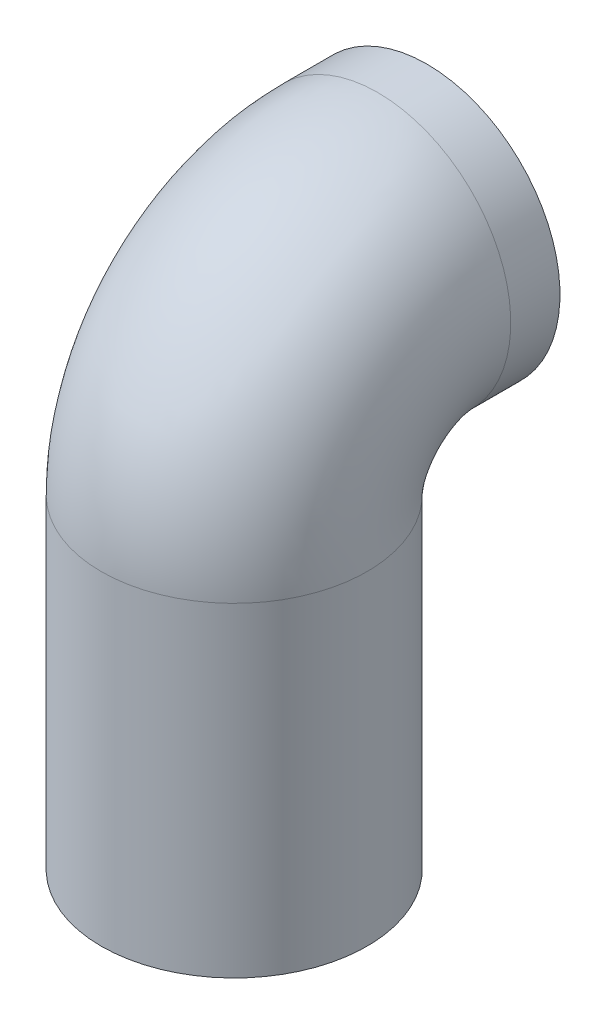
from build123d import *

# Parameters (mm, degrees)
SKETCH1_R      = 25
EXTRUDE1_DEPTH = 61
SKETCH3_R      = 25
SKETCH4_R      = 25
EXTRUDE2_DEPTH = 9.25


with BuildPart() as part:
    # Sketch1 → Extrude1 (new body)
    with BuildSketch(Plane(origin=(0, 0, 0), x_dir=(1, 0, 0), z_dir=(0, 1, 0))):
        with Locations(Location((0, 0, 0), (0, 0, 90))):
            Circle(SKETCH1_R)
    extrude(amount=EXTRUDE1_DEPTH)

    # Sweep1: sweep along a path in Sketch2
    with BuildLine(Plane(origin=(0, 0, 0), x_dir=(0, 0, -1), z_dir=(1, 0, 0))) as sweep1_path:
        ThreePointArc((27, 88), (7.908116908, 80.091883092), (0, 61))
    # Sketch3 → Sweep1 (sweep)
    with BuildSketch(Plane(origin=(0, 61, 0), x_dir=(-1, 0, 0), z_dir=(0, 1, 0))):
        Circle(SKETCH3_R)
    sweep(path=sweep1_path.line)

    # Sketch4 → Extrude2 (add)
    with BuildSketch(Plane(origin=(0, 0, -27), x_dir=(-1, 0, 0), z_dir=(0, 0, -1))):
        with Locations(Location((0, 88, 0), (0, 0, 90))):
            Circle(SKETCH4_R)
    extrude(amount=EXTRUDE2_DEPTH)


solid = part.part
